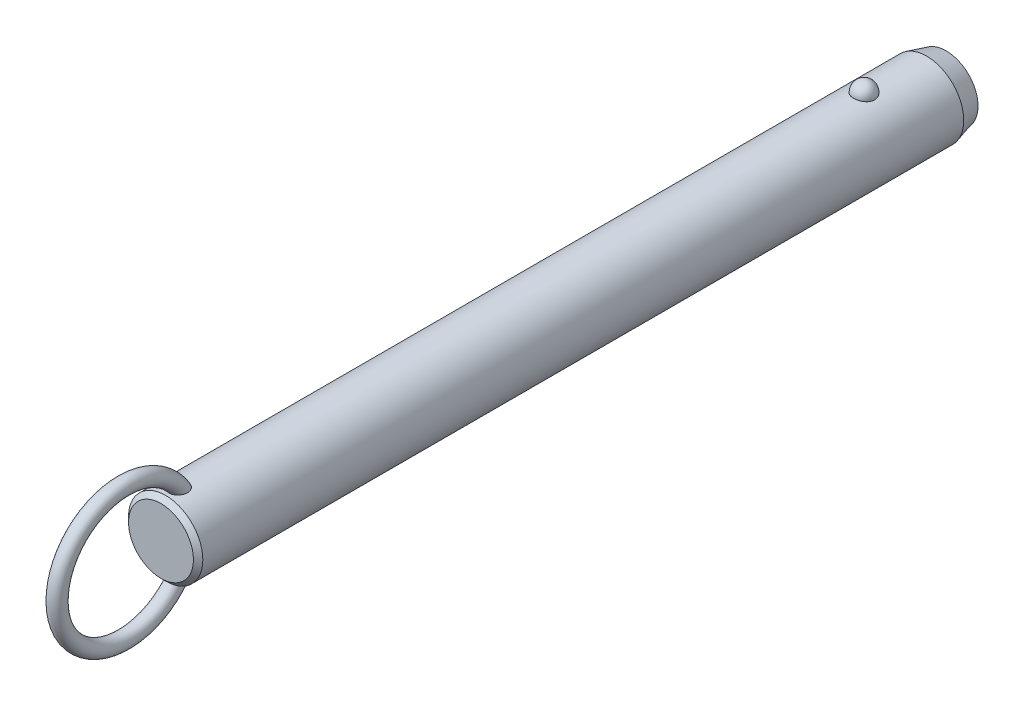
ISO-10303-21;
HEADER;
FILE_DESCRIPTION(('STEP AP214'),'2;1');
FILE_NAME('part.step','',(''),(''),'','','');
FILE_SCHEMA(('AUTOMOTIVE_DESIGN { 1 0 10303 214 1 1 1 1 }'));
ENDSEC;
DATA;
#1=APPLICATION_CONTEXT('core data for automotive mechanical design processes');
#2=APPLICATION_PROTOCOL_DEFINITION('international standard','automotive_design',2000,#1);
#3=PRODUCT_CONTEXT('',#1,'mechanical');
#4=PRODUCT('Part','Part','',(#3));
#5=PRODUCT_RELATED_PRODUCT_CATEGORY('part','',(#4));
#6=PRODUCT_DEFINITION_FORMATION('','',#4);
#7=PRODUCT_DEFINITION_CONTEXT('part definition',#1,'design');
#8=PRODUCT_DEFINITION('design','',#6,#7);
#9=PRODUCT_DEFINITION_SHAPE('','',#8);
#10=(LENGTH_UNIT() NAMED_UNIT(*) SI_UNIT(.MILLI.,.METRE.));
#11=(NAMED_UNIT(*) PLANE_ANGLE_UNIT() SI_UNIT($,.RADIAN.));
#12=(NAMED_UNIT(*) SI_UNIT($,.STERADIAN.) SOLID_ANGLE_UNIT());
#13=UNCERTAINTY_MEASURE_WITH_UNIT(LENGTH_MEASURE(1.E-05),#10,'distance_accuracy_value','');
#14=(GEOMETRIC_REPRESENTATION_CONTEXT(3) GLOBAL_UNCERTAINTY_ASSIGNED_CONTEXT((#13)) GLOBAL_UNIT_ASSIGNED_CONTEXT((#10,
#11,#12)) REPRESENTATION_CONTEXT('',''));
#15=CARTESIAN_POINT('',(0.,0.,0.));
#16=DIRECTION('',(0.,0.,1.));
#17=DIRECTION('',(1.,0.,0.));
#18=AXIS2_PLACEMENT_3D('',#15,#16,#17);
#19=CARTESIAN_POINT('',(0.,0.,167.6));
#20=DIRECTION('',(0.,0.,-1.));
#21=DIRECTION('',(-1.,0.,0.));
#22=AXIS2_PLACEMENT_3D('',#19,#20,#21);
#23=CYLINDRICAL_SURFACE('',#22,9.5);
#24=CARTESIAN_POINT('',(2.67259918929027,9.11631578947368,-2.70000000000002));
#25=CARTESIAN_POINT('',(2.6725968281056,9.11631786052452,-2.54909854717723));
#26=CARTESIAN_POINT('',(2.66030567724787,9.11994722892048,-2.39816735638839));
#27=CARTESIAN_POINT('',(2.6114347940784,9.13405924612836,-2.10058568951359));
#28=CARTESIAN_POINT('',(2.57484658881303,9.14454428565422,-1.95393672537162));
#29=CARTESIAN_POINT('',(2.47830875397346,9.17117631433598,-1.66916069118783));
#30=CARTESIAN_POINT('',(2.41836936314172,9.18732082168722,-1.53102991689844));
#31=CARTESIAN_POINT('',(2.27661331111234,9.22346780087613,-1.26705393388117));
#32=CARTESIAN_POINT('',(2.19479699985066,9.24347021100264,-1.14120852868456));
#33=CARTESIAN_POINT('',(2.01085282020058,9.28522401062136,-0.904632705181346));
#34=CARTESIAN_POINT('',(1.90862396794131,9.30698376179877,-0.793982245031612));
#35=CARTESIAN_POINT('',(1.6867437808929,9.34973971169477,-0.591607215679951));
#36=CARTESIAN_POINT('',(1.56709244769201,9.37073591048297,-0.499882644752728));
#37=CARTESIAN_POINT('',(1.31393976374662,9.40956370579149,-0.338167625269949));
#38=CARTESIAN_POINT('',(1.18048026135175,9.42740444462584,-0.268113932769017));
#39=CARTESIAN_POINT('',(0.903154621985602,9.45799906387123,-0.151390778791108));
#40=CARTESIAN_POINT('',(0.759289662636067,9.47075351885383,-0.104718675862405));
#41=CARTESIAN_POINT('',(0.468074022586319,9.48956256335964,-0.0367633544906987));
#42=CARTESIAN_POINT('',(0.320836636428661,9.49573643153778,-0.015027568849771));
#43=CARTESIAN_POINT('',(0.0246714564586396,9.50112183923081,0.00396199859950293));
#44=CARTESIAN_POINT('',(-0.124256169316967,9.50033406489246,0.00121819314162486));
#45=CARTESIAN_POINT('',(-0.417264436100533,9.4919475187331,-0.0284441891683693));
#46=CARTESIAN_POINT('',(-0.561384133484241,9.48444885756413,-0.0550074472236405));
#47=CARTESIAN_POINT('',(-0.842986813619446,9.46357853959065,-0.131064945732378));
#48=CARTESIAN_POINT('',(-0.98046968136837,9.450206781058,-0.180559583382));
#49=CARTESIAN_POINT('',(-1.24585005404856,9.41890822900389,-0.301476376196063));
#50=CARTESIAN_POINT('',(-1.37368611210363,9.40095498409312,-0.373026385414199));
#51=CARTESIAN_POINT('',(-1.61552738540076,9.3624296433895,-0.536025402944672));
#52=CARTESIAN_POINT('',(-1.72953116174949,9.34185727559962,-0.627476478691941));
#53=CARTESIAN_POINT('',(-1.9429225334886,9.29984568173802,-0.829844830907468));
#54=CARTESIAN_POINT('',(-2.04198021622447,9.27839736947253,-0.941108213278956));
#55=CARTESIAN_POINT('',(-2.2202646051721,9.23735994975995,-1.17883414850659));
#56=CARTESIAN_POINT('',(-2.29948985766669,9.21777097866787,-1.30529781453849));
#57=CARTESIAN_POINT('',(-2.43697287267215,9.18238994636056,-1.57158566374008));
#58=CARTESIAN_POINT('',(-2.49497068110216,9.16664569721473,-1.71155057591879));
#59=CARTESIAN_POINT('',(-2.5872073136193,9.14104303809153,-1.99961197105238));
#60=CARTESIAN_POINT('',(-2.62144683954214,9.13118445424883,-2.1477082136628));
#61=CARTESIAN_POINT('',(-2.66521466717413,9.11850622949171,-2.44715424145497));
#62=CARTESIAN_POINT('',(-2.67484831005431,9.11565658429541,-2.59848735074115));
#63=CARTESIAN_POINT('',(-2.66946735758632,9.11723375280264,-2.90067317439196));
#64=CARTESIAN_POINT('',(-2.65445345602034,9.12166036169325,-3.05152590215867));
#65=CARTESIAN_POINT('',(-2.6002971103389,9.13724422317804,-3.34766110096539));
#66=CARTESIAN_POINT('',(-2.56127978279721,9.14836656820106,-3.49296833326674));
#67=CARTESIAN_POINT('',(-2.46018844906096,9.17606676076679,-3.77477535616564));
#68=CARTESIAN_POINT('',(-2.39811349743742,9.19264483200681,-3.91127478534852));
#69=CARTESIAN_POINT('',(-2.25202303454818,9.22952198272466,-4.17244273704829));
#70=CARTESIAN_POINT('',(-2.16788714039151,9.24984129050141,-4.29704106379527));
#71=CARTESIAN_POINT('',(-1.9799408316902,9.29188255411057,-4.53013066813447));
#72=CARTESIAN_POINT('',(-1.87612963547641,9.31360456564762,-4.63862130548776));
#73=CARTESIAN_POINT('',(-1.65105429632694,9.35612959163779,-4.83690299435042));
#74=CARTESIAN_POINT('',(-1.52972405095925,9.37692871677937,-4.9266199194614));
#75=CARTESIAN_POINT('',(-1.27318250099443,9.41518970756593,-5.08429106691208));
#76=CARTESIAN_POINT('',(-1.13797219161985,9.432651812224,-5.15224684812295));
#77=CARTESIAN_POINT('',(-0.859280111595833,9.46208255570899,-5.26371827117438));
#78=CARTESIAN_POINT('',(-0.715925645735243,9.47411833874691,-5.30753421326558));
#79=CARTESIAN_POINT('',(-0.423550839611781,9.4916822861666,-5.37076321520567));
#80=CARTESIAN_POINT('',(-0.274531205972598,9.49721125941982,-5.39017930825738));
#81=CARTESIAN_POINT('',(0.0218446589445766,9.50110860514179,-5.40390587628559));
#82=CARTESIAN_POINT('',(0.169177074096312,9.49961381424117,-5.39869609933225));
#83=CARTESIAN_POINT('',(0.460808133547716,9.48993906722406,-5.36441955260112));
#84=CARTESIAN_POINT('',(0.605106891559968,9.48175936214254,-5.33535367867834));
#85=CARTESIAN_POINT('',(0.886027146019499,9.4596376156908,-5.25435587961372));
#86=CARTESIAN_POINT('',(1.02267710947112,9.44571881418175,-5.20251612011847));
#87=CARTESIAN_POINT('',(1.28523827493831,9.41358993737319,-5.07741549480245));
#88=CARTESIAN_POINT('',(1.41114877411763,9.39537958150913,-5.00415322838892));
#89=CARTESIAN_POINT('',(1.65085227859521,9.3562644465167,-4.83684599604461));
#90=CARTESIAN_POINT('',(1.76442346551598,9.33532178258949,-4.74249218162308));
#91=CARTESIAN_POINT('',(1.97425672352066,9.29321198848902,-4.53620389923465));
#92=CARTESIAN_POINT('',(2.07051582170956,9.27204482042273,-4.42426641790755));
#93=CARTESIAN_POINT('',(2.24490086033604,9.23139221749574,-4.18363183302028));
#94=CARTESIAN_POINT('',(2.32267019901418,9.21194380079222,-4.05466990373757));
#95=CARTESIAN_POINT('',(2.45584092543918,9.1773419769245,-3.78517836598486));
#96=CARTESIAN_POINT('',(2.51124979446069,9.16218713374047,-3.644652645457));
#97=CARTESIAN_POINT('',(2.59380876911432,9.13913522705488,-3.37104301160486));
#98=CARTESIAN_POINT('',(2.62330266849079,9.13064624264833,-3.23871053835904));
#99=CARTESIAN_POINT('',(2.66269870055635,9.11923566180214,-2.97092664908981));
#100=CARTESIAN_POINT('',(2.67260130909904,9.11631393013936,-2.83547530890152));
#101=CARTESIAN_POINT('',(2.67259918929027,9.11631578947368,-2.70000000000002));
#102=B_SPLINE_CURVE_WITH_KNOTS('',3,(#24,#25,#26,#27,#28,#29,#30,#31,#32,#33,#34,#35,#36,#37,
#38,#39,#40,#41,#42,#43,#44,#45,#46,#47,#48,#49,#50,#51,#52,#53,#54,#55,#56,#57,#58,#59,#60,#61,
#62,#63,#64,#65,#66,#67,#68,#69,#70,#71,#72,#73,#74,#75,#76,#77,#78,#79,#80,#81,#82,#83,#84,#85,
#86,#87,#88,#89,#90,#91,#92,#93,#94,#95,#96,#97,#98,#99,#100,#101),.UNSPECIFIED.,.T.,.F.,(4,2,2,
2,2,2,2,2,2,2,2,2,2,2,2,2,2,2,2,2,2,2,2,2,2,2,2,2,2,2,2,2,2,2,2,2,2,2,4),(0.,0.452217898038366,
0.904593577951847,1.35677112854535,1.80894144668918,2.26340676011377,2.71787203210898,
3.17099820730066,3.62407318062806,4.0687883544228,4.51345969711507,4.95160616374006,
5.38976021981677,5.83050358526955,6.27129275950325,6.72071308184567,7.17016633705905,
7.62495278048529,8.07972578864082,8.53254856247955,8.98535859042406,9.43582813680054,
9.88631615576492,10.3393155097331,10.7923328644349,11.2471065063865,11.7018475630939,
12.1507959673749,12.5996885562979,13.0398725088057,13.4800399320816,13.9184421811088,
14.3568730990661,14.802202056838,15.2476074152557,15.7010097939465,16.1542603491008,
16.5602594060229,16.9662486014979),.UNSPECIFIED.);
#103=CARTESIAN_POINT('',(2.67259918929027,9.11631578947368,-2.70000000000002));
#104=VERTEX_POINT('',#103);
#105=EDGE_CURVE('E41',#104,#104,#102,.T.);
#106=ORIENTED_EDGE('',*,*,#105,.T.);
#107=EDGE_LOOP('',(#106));
#108=FACE_BOUND('',#107,.T.);
#109=CARTESIAN_POINT('',(0.,0.,175.92));
#110=DIRECTION('',(0.,0.,1.));
#111=DIRECTION('',(1.,0.,0.));
#112=AXIS2_PLACEMENT_3D('',#109,#110,#111);
#113=CIRCLE('',#112,9.5);
#114=CARTESIAN_POINT('',(9.5,0.,175.92));
#115=VERTEX_POINT('',#114);
#116=EDGE_CURVE('E10',#115,#115,#113,.F.);
#117=ORIENTED_EDGE('',*,*,#116,.T.);
#118=EDGE_LOOP('',(#117));
#119=FACE_BOUND('',#118,.T.);
#120=CARTESIAN_POINT('',(-0.697062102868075,-9.47439269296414,170.267808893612));
#121=CARTESIAN_POINT('',(-0.799579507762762,-9.46685146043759,170.307482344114));
#122=CARTESIAN_POINT('',(-0.89857563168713,-9.45788043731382,170.3559309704));
#123=CARTESIAN_POINT('',(-1.08670047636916,-9.43811593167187,170.468868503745));
#124=CARTESIAN_POINT('',(-1.17583204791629,-9.42732297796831,170.533352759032));
#125=CARTESIAN_POINT('',(-1.34179806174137,-9.40513672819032,170.676209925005));
#126=CARTESIAN_POINT('',(-1.41865133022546,-9.39374438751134,170.754561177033));
#127=CARTESIAN_POINT('',(-1.5586004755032,-9.37154196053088,170.922752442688));
#128=CARTESIAN_POINT('',(-1.62169476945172,-9.3607319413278,171.01259377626));
#129=CARTESIAN_POINT('',(-1.73527695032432,-9.34035749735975,171.204500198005));
#130=CARTESIAN_POINT('',(-1.7852226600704,-9.33085270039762,171.306891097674));
#131=CARTESIAN_POINT('',(-1.86924997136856,-9.3143834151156,171.518148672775));
#132=CARTESIAN_POINT('',(-1.90332570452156,-9.30741986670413,171.627017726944));
#133=CARTESIAN_POINT('',(-1.95893603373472,-9.29588482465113,171.860473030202));
#134=CARTESIAN_POINT('',(-1.97872420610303,-9.29165182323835,171.985489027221));
#135=CARTESIAN_POINT('',(-2.00062129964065,-9.28695978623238,172.237080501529));
#136=CARTESIAN_POINT('',(-2.00272284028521,-9.28650232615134,172.363656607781));
#137=CARTESIAN_POINT('',(-1.98958876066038,-9.28932750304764,172.636815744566));
#138=CARTESIAN_POINT('',(-1.97143366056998,-9.2932400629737,172.783251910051));
#139=CARTESIAN_POINT('',(-1.91479925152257,-9.30507151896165,173.072062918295));
#140=CARTESIAN_POINT('',(-1.87629122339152,-9.31299607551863,173.214431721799));
#141=CARTESIAN_POINT('',(-1.77225683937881,-9.33340232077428,173.515172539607));
#142=CARTESIAN_POINT('',(-1.70334898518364,-9.34641636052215,173.672369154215));
#143=CARTESIAN_POINT('',(-1.58111062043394,-9.36759153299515,173.897517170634));
#144=CARTESIAN_POINT('',(-1.53721459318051,-9.37492619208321,173.970796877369));
#145=CARTESIAN_POINT('',(-1.44302631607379,-9.38988566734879,174.11307405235));
#146=CARTESIAN_POINT('',(-1.39273721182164,-9.39751033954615,174.182073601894));
#147=CARTESIAN_POINT('',(-1.26775962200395,-9.41530678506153,174.336983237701));
#148=CARTESIAN_POINT('',(-1.19052326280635,-9.42548108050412,174.420871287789));
#149=CARTESIAN_POINT('',(-1.02420241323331,-9.44499825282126,174.576008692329));
#150=CARTESIAN_POINT('',(-0.935139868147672,-9.45434261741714,174.647280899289));
#151=CARTESIAN_POINT('',(-0.76661041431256,-9.46930670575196,174.758695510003));
#152=CARTESIAN_POINT('',(-0.689439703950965,-9.47529223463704,174.802235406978));
#153=CARTESIAN_POINT('',(-0.528942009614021,-9.48560294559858,174.87631336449));
#154=CARTESIAN_POINT('',(-0.445620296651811,-9.48992953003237,174.906862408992));
#155=CARTESIAN_POINT('',(-0.273901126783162,-9.49644161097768,174.952579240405));
#156=CARTESIAN_POINT('',(-0.18546574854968,-9.49860811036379,174.96761059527));
#157=CARTESIAN_POINT('',(-0.00734541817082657,-9.5004135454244,174.980149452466));
#158=CARTESIAN_POINT('',(0.082338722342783,-9.50005405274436,174.977667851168));
#159=CARTESIAN_POINT('',(0.247679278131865,-9.49708301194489,174.956995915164));
#160=CARTESIAN_POINT('',(0.323620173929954,-9.49477609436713,174.940930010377));
#161=CARTESIAN_POINT('',(0.471981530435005,-9.48855917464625,174.897172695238));
#162=CARTESIAN_POINT('',(0.544400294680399,-9.48464840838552,174.869475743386));
#163=CARTESIAN_POINT('',(0.708947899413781,-9.47398336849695,174.79280266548));
#164=CARTESIAN_POINT('',(0.799149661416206,-9.46671310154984,174.739774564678));
#165=CARTESIAN_POINT('',(0.969783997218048,-9.45076225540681,174.619973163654));
#166=CARTESIAN_POINT('',(1.05019415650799,-9.44207854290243,174.553169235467));
#167=CARTESIAN_POINT('',(1.23092343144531,-9.42051459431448,174.380759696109));
#168=CARTESIAN_POINT('',(1.32652499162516,-9.40733378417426,174.27026193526));
#169=CARTESIAN_POINT('',(1.49893121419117,-9.38140745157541,174.035561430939));
#170=CARTESIAN_POINT('',(1.57571616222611,-9.36866239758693,173.911344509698));
#171=CARTESIAN_POINT('',(1.71285426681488,-9.34457644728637,173.649389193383));
#172=CARTESIAN_POINT('',(1.77266365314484,-9.33328726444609,173.51136233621));
#173=CARTESIAN_POINT('',(1.87239208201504,-9.31379209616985,173.228051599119));
#174=CARTESIAN_POINT('',(1.91230158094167,-9.30558759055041,173.082764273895));
#175=CARTESIAN_POINT('',(1.97604189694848,-9.29228394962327,172.762028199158));
#176=CARTESIAN_POINT('',(1.9958743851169,-9.28797202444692,172.585724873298));
#177=CARTESIAN_POINT('',(2.00295708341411,-9.28645519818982,172.232414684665));
#178=CARTESIAN_POINT('',(1.99025930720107,-9.28923895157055,172.055409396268));
#179=CARTESIAN_POINT('',(1.93735479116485,-9.30038134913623,171.756338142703));
#180=CARTESIAN_POINT('',(1.90576827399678,-9.30697680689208,171.632667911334));
#181=CARTESIAN_POINT('',(1.82287484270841,-9.32356855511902,171.392329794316));
#182=CARTESIAN_POINT('',(1.77158213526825,-9.33356239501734,171.275656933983));
#183=CARTESIAN_POINT('',(1.64885744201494,-9.35602275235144,171.052706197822));
#184=CARTESIAN_POINT('',(1.57730995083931,-9.36850332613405,170.946492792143));
#185=CARTESIAN_POINT('',(1.41543264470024,-9.39431873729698,170.749553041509));
#186=CARTESIAN_POINT('',(1.32510883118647,-9.40765330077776,170.658821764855));
#187=CARTESIAN_POINT('',(1.13846223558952,-9.43195720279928,170.505033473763));
#188=CARTESIAN_POINT('',(1.04369890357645,-9.44302894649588,170.440094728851));
#189=CARTESIAN_POINT('',(0.843965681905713,-9.46296805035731,170.328038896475));
#190=CARTESIAN_POINT('',(0.739000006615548,-9.47183631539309,170.280914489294));
#191=CARTESIAN_POINT('',(0.528175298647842,-9.48586140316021,170.208117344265));
#192=CARTESIAN_POINT('',(0.422686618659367,-9.49119633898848,170.18140249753));
#193=CARTESIAN_POINT('',(0.208590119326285,-9.49831365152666,170.146013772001));
#194=CARTESIAN_POINT('',(0.0999817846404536,-9.500095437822,170.137342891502));
#195=CARTESIAN_POINT('',(-0.126104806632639,-9.49988861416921,170.138350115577));
#196=CARTESIAN_POINT('',(-0.243578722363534,-9.49757821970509,170.149594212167));
#197=CARTESIAN_POINT('',(-0.474390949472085,-9.48885165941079,170.193167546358));
#198=CARTESIAN_POINT('',(-0.587729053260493,-9.48243528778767,170.225497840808));
#199=CARTESIAN_POINT('',(-0.697062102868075,-9.47439269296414,170.267808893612));
#200=B_SPLINE_CURVE_WITH_KNOTS('',3,(#120,#121,#122,#123,#124,#125,#126,#127,#128,#129,#130,
#131,#132,#133,#134,#135,#136,#137,#138,#139,#140,#141,#142,#143,#144,#145,#146,#147,#148,#149,
#150,#151,#152,#153,#154,#155,#156,#157,#158,#159,#160,#161,#162,#163,#164,#165,#166,#167,#168,
#169,#170,#171,#172,#173,#174,#175,#176,#177,#178,#179,#180,#181,#182,#183,#184,#185,#186,#187,
#188,#189,#190,#191,#192,#193,#194,#195,#196,#197,#198,#199),.UNSPECIFIED.,.T.,.F.,(4,2,2,2,2,2,
2,2,2,2,2,2,2,2,2,2,2,2,2,2,2,2,2,2,2,2,2,2,2,2,2,2,2,2,2,2,2,2,2,4),(0.,0.330119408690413,
0.6601431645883,0.98965593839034,1.31920659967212,1.66074728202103,2.00241415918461,
2.38088696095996,2.75951768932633,3.20065679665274,3.64242004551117,4.15620996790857,
4.41314162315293,4.66994734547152,5.01228664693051,5.35399933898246,5.6194303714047,
5.88463652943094,6.15215502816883,6.41950709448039,6.65144391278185,6.88349136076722,
7.19641200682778,7.51003602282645,7.94779711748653,8.3860149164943,8.83699707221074,
9.28819530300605,9.81778662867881,10.34653170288,10.7284172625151,11.1100280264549,
11.4938603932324,11.8775702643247,12.2220189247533,12.5663259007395,12.8915939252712,
13.2169159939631,13.5689650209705,13.9210316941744),.UNSPECIFIED.);
#201=CARTESIAN_POINT('',(-0.697062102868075,-9.47439269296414,170.267808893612));
#202=VERTEX_POINT('',#201);
#203=EDGE_CURVE('E59',#202,#202,#200,.T.);
#204=ORIENTED_EDGE('',*,*,#203,.T.);
#205=EDGE_LOOP('',(#204));
#206=FACE_BOUND('',#205,.T.);
#207=CARTESIAN_POINT('',(-0.697062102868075,9.47439269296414,170.267808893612));
#208=CARTESIAN_POINT('',(-0.597792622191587,9.48169483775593,170.22939564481));
#209=CARTESIAN_POINT('',(-0.495106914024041,9.48766580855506,170.199168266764));
#210=CARTESIAN_POINT('',(-0.285876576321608,9.49627648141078,170.156032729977));
#211=CARTESIAN_POINT('',(-0.179324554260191,9.49890941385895,170.143159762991));
#212=CARTESIAN_POINT('',(0.0344157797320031,9.50053798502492,170.135166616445));
#213=CARTESIAN_POINT('',(0.141603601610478,9.49953613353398,170.140034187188));
#214=CARTESIAN_POINT('',(0.353563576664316,9.49401038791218,170.167365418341));
#215=CARTESIAN_POINT('',(0.458336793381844,9.48948807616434,170.18982117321));
#216=CARTESIAN_POINT('',(0.662493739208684,9.4774236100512,170.251671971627));
#217=CARTESIAN_POINT('',(0.761881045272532,9.46988348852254,170.291055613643));
#218=CARTESIAN_POINT('',(0.952608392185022,9.45260382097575,170.385634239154));
#219=CARTESIAN_POINT('',(1.04394806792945,9.44286417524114,170.440829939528));
#220=CARTESIAN_POINT('',(1.21712767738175,9.42211760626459,170.566066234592));
#221=CARTESIAN_POINT('',(1.29885671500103,9.41109835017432,170.636257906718));
#222=CARTESIAN_POINT('',(1.4497897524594,9.38903310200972,170.788980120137));
#223=CARTESIAN_POINT('',(1.51899278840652,9.37798710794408,170.871511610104));
#224=CARTESIAN_POINT('',(1.64602857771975,9.35654375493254,171.049776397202));
#225=CARTESIAN_POINT('',(1.70333052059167,9.34618688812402,171.145891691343));
#226=CARTESIAN_POINT('',(1.80259341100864,9.32755128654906,171.345897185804));
#227=CARTESIAN_POINT('',(1.84454942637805,9.31927322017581,171.449789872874));
#228=CARTESIAN_POINT('',(1.91637039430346,9.30478365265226,171.672213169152));
#229=CARTESIAN_POINT('',(1.944805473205,9.29882552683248,171.791219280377));
#230=CARTESIAN_POINT('',(1.98449865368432,9.29043398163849,172.032143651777));
#231=CARTESIAN_POINT('',(1.99574908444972,9.28800213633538,172.154063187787));
#232=CARTESIAN_POINT('',(2.00275141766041,9.28649645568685,172.416932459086));
#233=CARTESIAN_POINT('',(1.99588238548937,9.28799035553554,172.557952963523));
#234=CARTESIAN_POINT('',(1.96270559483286,9.29505517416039,172.837621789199));
#235=CARTESIAN_POINT('',(1.93637872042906,9.30063010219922,172.976267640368));
#236=CARTESIAN_POINT('',(1.85949176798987,9.31633564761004,173.272561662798));
#237=CARTESIAN_POINT('',(1.80549792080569,9.3270926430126,173.429290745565));
#238=CARTESIAN_POINT('',(1.67376869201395,9.35163064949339,173.732284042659));
#239=CARTESIAN_POINT('',(1.59603181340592,9.36541185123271,173.878547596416));
#240=CARTESIAN_POINT('',(1.4360277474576,9.39110706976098,174.125813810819));
#241=CARTESIAN_POINT('',(1.35831795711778,9.40278656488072,174.229791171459));
#242=CARTESIAN_POINT('',(1.18774483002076,9.42585025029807,174.424534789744));
#243=CARTESIAN_POINT('',(1.09490932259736,9.43723493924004,174.515324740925));
#244=CARTESIAN_POINT('',(0.921110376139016,9.45552616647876,174.65620334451));
#245=CARTESIAN_POINT('',(0.843738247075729,9.46281058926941,174.710656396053));
#246=CARTESIAN_POINT('',(0.681245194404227,9.47589120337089,174.806711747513));
#247=CARTESIAN_POINT('',(0.596135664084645,9.48168953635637,174.848332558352));
#248=CARTESIAN_POINT('',(0.433779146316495,9.49038144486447,174.910089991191));
#249=CARTESIAN_POINT('',(0.35745955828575,9.49359170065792,174.93260136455));
#250=CARTESIAN_POINT('',(0.202074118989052,9.49816761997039,174.964574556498));
#251=CARTESIAN_POINT('',(0.123010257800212,9.49953459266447,174.974045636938));
#252=CARTESIAN_POINT('',(-0.0357372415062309,9.50026497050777,174.979114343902));
#253=CARTESIAN_POINT('',(-0.115421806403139,9.49962433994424,174.974684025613));
#254=CARTESIAN_POINT('',(-0.272823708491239,9.49640854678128,174.952296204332));
#255=CARTESIAN_POINT('',(-0.350540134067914,9.4938325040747,174.934332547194));
#256=CARTESIAN_POINT('',(-0.500580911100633,9.48709462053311,174.886802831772));
#257=CARTESIAN_POINT('',(-0.572979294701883,9.48296359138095,174.857461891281));
#258=CARTESIAN_POINT('',(-0.712864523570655,9.47347609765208,174.789008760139));
#259=CARTESIAN_POINT('',(-0.780349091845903,9.46811906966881,174.749892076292));
#260=CARTESIAN_POINT('',(-0.946309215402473,9.45329720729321,174.639432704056));
#261=CARTESIAN_POINT('',(-1.04090230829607,9.44321512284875,174.562329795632));
#262=CARTESIAN_POINT('',(-1.21661929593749,9.42219227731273,174.39409718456));
#263=CARTESIAN_POINT('',(-1.29770519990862,9.41124921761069,174.302929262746));
#264=CARTESIAN_POINT('',(-1.47319646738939,9.38563439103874,174.076162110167));
#265=CARTESIAN_POINT('',(-1.5620887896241,9.37102009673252,173.936289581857));
#266=CARTESIAN_POINT('',(-1.71623987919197,9.34401559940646,173.643950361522));
#267=CARTESIAN_POINT('',(-1.7814786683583,9.33162728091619,173.491473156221));
#268=CARTESIAN_POINT('',(-1.88853837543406,9.31055541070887,173.175647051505));
#269=CARTESIAN_POINT('',(-1.92998995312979,9.30193076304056,173.012168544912));
#270=CARTESIAN_POINT('',(-1.98590726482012,9.29015757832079,172.680526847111));
#271=CARTESIAN_POINT('',(-2.0004070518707,9.2870021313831,172.512369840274));
#272=CARTESIAN_POINT('',(-1.99964701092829,9.28716218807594,172.205080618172));
#273=CARTESIAN_POINT('',(-1.98908145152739,9.28945704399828,172.065936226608));
#274=CARTESIAN_POINT('',(-1.94566294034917,9.29865169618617,171.791153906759));
#275=CARTESIAN_POINT('',(-1.91282062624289,9.30554929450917,171.655514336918));
#276=CARTESIAN_POINT('',(-1.84582133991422,9.31898248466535,171.457802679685));
#277=CARTESIAN_POINT('',(-1.82038084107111,9.32400364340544,171.392583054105));
#278=CARTESIAN_POINT('',(-1.7635051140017,9.33492884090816,171.264903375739));
#279=CARTESIAN_POINT('',(-1.73207305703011,9.34083241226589,171.202441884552));
#280=CARTESIAN_POINT('',(-1.66324243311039,9.353333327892,171.08094078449));
#281=CARTESIAN_POINT('',(-1.62584239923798,9.35993084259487,171.021902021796));
#282=CARTESIAN_POINT('',(-1.54527678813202,9.37356864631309,170.907987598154));
#283=CARTESIAN_POINT('',(-1.50211241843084,9.38060884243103,170.853111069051));
#284=CARTESIAN_POINT('',(-1.37681147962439,9.40004442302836,170.709961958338));
#285=CARTESIAN_POINT('',(-1.28916358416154,9.41261047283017,170.626429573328));
#286=CARTESIAN_POINT('',(-1.09996826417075,9.43658180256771,170.477236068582));
#287=CARTESIAN_POINT('',(-0.99846185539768,9.44799034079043,170.411523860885));
#288=CARTESIAN_POINT('',(-0.860188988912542,9.46103017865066,170.3394367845));
#289=CARTESIAN_POINT('',(-0.828141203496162,9.46389141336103,170.323851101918));
#290=CARTESIAN_POINT('',(-0.763210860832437,9.46934915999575,170.294473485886));
#291=CARTESIAN_POINT('',(-0.730328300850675,9.47194567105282,170.280681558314));
#292=CARTESIAN_POINT('',(-0.697062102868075,9.47439269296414,170.267808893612));
#293=B_SPLINE_CURVE_WITH_KNOTS('',3,(#207,#208,#209,#210,#211,#212,#213,#214,#215,#216,#217,
#218,#219,#220,#221,#222,#223,#224,#225,#226,#227,#228,#229,#230,#231,#232,#233,#234,#235,#236,
#237,#238,#239,#240,#241,#242,#243,#244,#245,#246,#247,#248,#249,#250,#251,#252,#253,#254,#255,
#256,#257,#258,#259,#260,#261,#262,#263,#264,#265,#266,#267,#268,#269,#270,#271,#272,#273,#274,
#275,#276,#277,#278,#279,#280,#281,#282,#283,#284,#285,#286,#287,#288,#289,#290,#291,#292),
.UNSPECIFIED.,.T.,.F.,(4,2,2,2,2,2,2,2,2,2,2,2,2,2,2,2,2,2,2,2,2,2,2,2,2,2,2,2,2,2,2,2,2,2,2,2,
2,2,2,2,2,2,4),(0.,0.319942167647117,0.640532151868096,0.960900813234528,1.28112555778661,
1.60113495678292,1.92115886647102,2.24457323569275,2.56801248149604,2.90371927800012,
3.23953387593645,3.60560313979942,3.97183576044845,4.39383693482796,4.8162532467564,
5.31257045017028,5.80891895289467,6.19868344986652,6.58773876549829,6.87145417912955,
7.15475838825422,7.39263751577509,7.63034760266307,7.86853584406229,8.10683246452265,
8.34063661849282,8.57454843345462,8.93983939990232,9.30614105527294,9.80266668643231,
10.2996107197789,10.8040753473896,11.3079021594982,11.7249776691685,12.1418541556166,
12.3521485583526,12.5623319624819,12.7725671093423,12.9827582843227,13.345827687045,
13.7078449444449,13.8150604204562,13.9222762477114),.UNSPECIFIED.);
#294=CARTESIAN_POINT('',(-0.697062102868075,9.47439269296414,170.267808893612));
#295=VERTEX_POINT('',#294);
#296=EDGE_CURVE('E67',#295,#295,#293,.T.);
#297=ORIENTED_EDGE('',*,*,#296,.T.);
#298=EDGE_LOOP('',(#297));
#299=FACE_BOUND('',#298,.T.);
#300=CARTESIAN_POINT('',(0.,0.,-18.7));
#301=DIRECTION('',(0.,0.,-1.));
#302=DIRECTION('',(-1.,0.,0.));
#303=AXIS2_PLACEMENT_3D('',#300,#301,#302);
#304=CIRCLE('',#303,9.5);
#305=CARTESIAN_POINT('',(-9.5,0.,-18.7));
#306=VERTEX_POINT('',#305);
#307=EDGE_CURVE('E56',#306,#306,#304,.F.);
#308=ORIENTED_EDGE('',*,*,#307,.T.);
#309=EDGE_LOOP('',(#308));
#310=FACE_BOUND('',#309,.T.);
#311=ADVANCED_FACE('F37',(#108,#119,#206,#299,#310),#23,.T.);
#312=CARTESIAN_POINT('',(0.,0.,-23.7));
#313=DIRECTION('',(0.,0.,-1.));
#314=DIRECTION('',(-1.,0.,0.));
#315=AXIS2_PLACEMENT_3D('',#312,#313,#314);
#316=PLANE('',#315);
#317=CARTESIAN_POINT('',(0.,0.,-23.7));
#318=DIRECTION('',(0.,0.,-1.));
#319=DIRECTION('',(-1.,0.,0.));
#320=AXIS2_PLACEMENT_3D('',#317,#318,#319);
#321=CIRCLE('',#320,8.16025403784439);
#322=CARTESIAN_POINT('',(-8.16025403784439,0.,-23.7));
#323=VERTEX_POINT('',#322);
#324=EDGE_CURVE('E66',#323,#323,#321,.T.);
#325=ORIENTED_EDGE('',*,*,#324,.T.);
#326=EDGE_LOOP('',(#325));
#327=FACE_BOUND('',#326,.T.);
#328=ADVANCED_FACE('F85',(#327),#316,.T.);
#329=CARTESIAN_POINT('',(0.,0.,-23.7));
#330=DIRECTION('',(0.,0.,1.));
#331=DIRECTION('',(1.,0.,0.));
#332=AXIS2_PLACEMENT_3D('',#329,#330,#331);
#333=CONICAL_SURFACE('',#332,8.16025403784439,0.261799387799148);
#334=ORIENTED_EDGE('',*,*,#307,.F.);
#335=EDGE_LOOP('',(#334));
#336=FACE_BOUND('',#335,.T.);
#337=ORIENTED_EDGE('',*,*,#324,.F.);
#338=EDGE_LOOP('',(#337));
#339=FACE_BOUND('',#338,.T.);
#340=ADVANCED_FACE('F83',(#336,#339),#333,.T.);
#341=CARTESIAN_POINT('',(0.,0.,177.12));
#342=DIRECTION('',(0.,0.,1.));
#343=DIRECTION('',(1.,0.,0.));
#344=AXIS2_PLACEMENT_3D('',#341,#342,#343);
#345=PLANE('',#344);
#346=CARTESIAN_POINT('',(0.,0.,177.12));
#347=DIRECTION('',(0.,0.,1.));
#348=DIRECTION('',(1.,0.,0.));
#349=AXIS2_PLACEMENT_3D('',#346,#347,#348);
#350=CIRCLE('',#349,8.30000000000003);
#351=CARTESIAN_POINT('',(8.30000000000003,0.,177.12));
#352=VERTEX_POINT('',#351);
#353=EDGE_CURVE('E50',#352,#352,#350,.T.);
#354=ORIENTED_EDGE('',*,*,#353,.T.);
#355=EDGE_LOOP('',(#354));
#356=FACE_BOUND('',#355,.T.);
#357=ADVANCED_FACE('F77',(#356),#345,.T.);
#358=CARTESIAN_POINT('',(0.,0.,186.65));
#359=DIRECTION('',(1.,0.,0.));
#360=DIRECTION('',(0.,0.,-1.));
#361=AXIS2_PLACEMENT_3D('',#358,#359,#360);
#362=TOROIDAL_SURFACE('',#361,17.05,2.);
#363=ORIENTED_EDGE('',*,*,#296,.F.);
#364=EDGE_LOOP('',(#363));
#365=FACE_BOUND('',#364,.T.);
#366=ORIENTED_EDGE('',*,*,#203,.F.);
#367=EDGE_LOOP('',(#366));
#368=FACE_BOUND('',#367,.T.);
#369=ADVANCED_FACE('F73',(#365,#368),#362,.T.);
#370=CARTESIAN_POINT('',(0.,0.,177.12));
#371=DIRECTION('',(0.,0.,-1.));
#372=DIRECTION('',(-1.,0.,0.));
#373=AXIS2_PLACEMENT_3D('',#370,#371,#372);
#374=CONICAL_SURFACE('',#373,8.30000000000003,0.785398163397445);
#375=ORIENTED_EDGE('',*,*,#116,.F.);
#376=EDGE_LOOP('',(#375));
#377=FACE_BOUND('',#376,.T.);
#378=ORIENTED_EDGE('',*,*,#353,.F.);
#379=EDGE_LOOP('',(#378));
#380=FACE_BOUND('',#379,.T.);
#381=ADVANCED_FACE('F39',(#377,#380),#374,.T.);
#382=CARTESIAN_POINT('',(0.,9.5,-2.70000000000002));
#383=DIRECTION('',(0.,1.,0.));
#384=DIRECTION('',(0.,0.,-1.));
#385=AXIS2_PLACEMENT_3D('',#382,#383,#384);
#386=SPHERICAL_SURFACE('',#385,2.7);
#387=ORIENTED_EDGE('',*,*,#105,.F.);
#388=EDGE_LOOP('',(#387));
#389=FACE_BOUND('',#388,.T.);
#390=ADVANCED_FACE('F79',(#389),#386,.T.);
#391=CLOSED_SHELL('',(#311,#328,#340,#357,#369,#381,#390));
#392=MANIFOLD_SOLID_BREP('B2',#391);
#393=ADVANCED_BREP_SHAPE_REPRESENTATION('',(#18,#392),#14);
#394=SHAPE_DEFINITION_REPRESENTATION(#9,#393);
ENDSEC;
END-ISO-10303-21;
